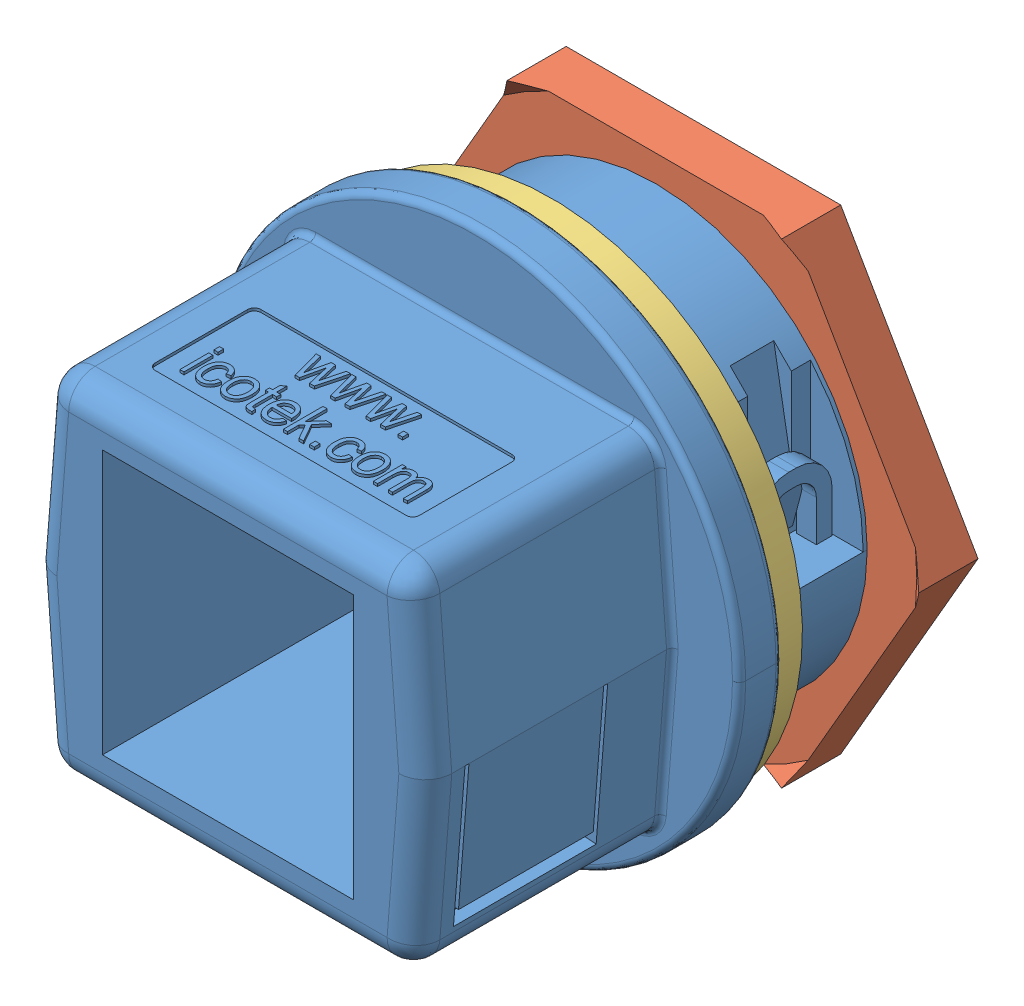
SolidWorks assembly 99432.SLDASM, configuration Default (file format 8000). Lengths in mm.
Overall size (43.31 40 36).
3 component instances, 3 part files, 0 mates.
Components (placement in the parent):
- 99432_01-1: 99432_01.SLDPRT [Default] at origin size (40 40 36)
- 99432_02-1: 99432_02.SLDPRT [Default] at origin size (43.31 39.01 4.49)
- 99432_03-1: 99432_03.SLDPRT [Default] at origin size (38 38 2.5)
